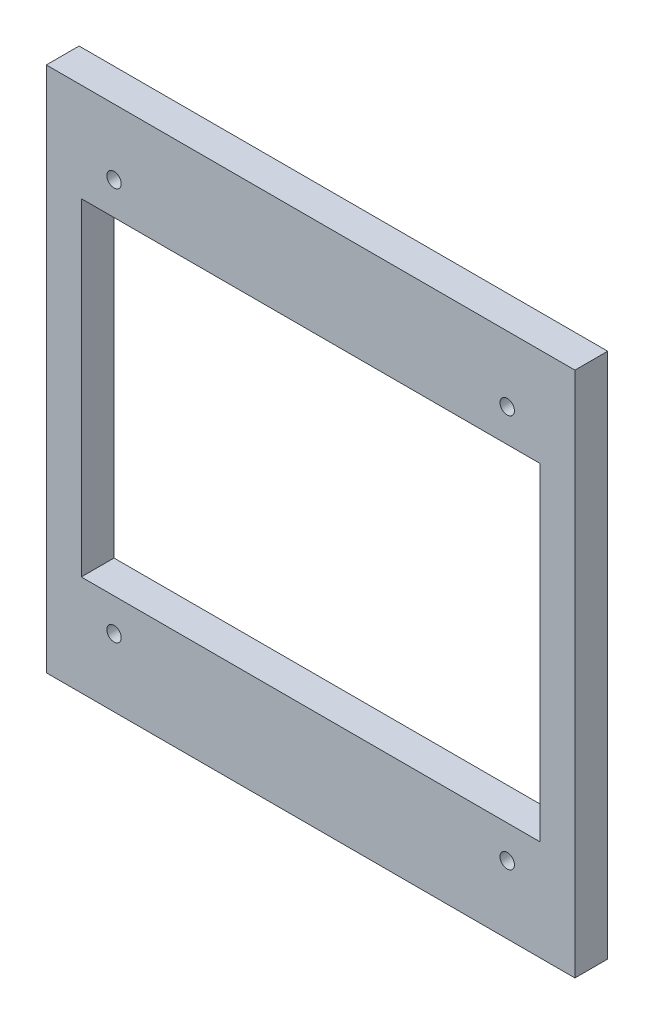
from build123d import *

# Parameters (mm, degrees)
SKETCH1_W          = 614.68
SKETCH1_H          = 612.14
SKETCH1_W_2        = 533.4
SKETCH1_H_2        = 381
EXTRUDE1_DEPTH     = 38.1
SKETCH2_R          = 8.382
CUT_EXTRUDE1_DEPTH = 865.742244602


with BuildPart() as part:
    # Sketch1 → Extrude1 (new body)
    with BuildSketch(Plane.XY):
        with Locations((304.8, 303.53)):
            Rectangle(SKETCH1_W, SKETCH1_H)
        with Locations((304.8, 304.8)):
            Rectangle(SKETCH1_W_2, SKETCH1_H_2, mode=Mode.SUBTRACT)
    extrude(amount=EXTRUDE1_DEPTH)

    # Sketch2 → Cut-Extrude1 (cut, through all)
    with BuildSketch(Plane(origin=(0, 0, 0), x_dir=(-1, 0, 0), z_dir=(0, 0, -1))):
        with Locations((-76.2, 76.2)):
            Circle(SKETCH2_R)
        with Locations((-533.4, 76.2)):
            Circle(SKETCH2_R)
        with Locations((-76.2, 533.4)):
            Circle(SKETCH2_R)
        with Locations((-533.4, 533.4)):
            Circle(SKETCH2_R)
    extrude(amount=-CUT_EXTRUDE1_DEPTH, mode=Mode.SUBTRACT)


solid = part.part
